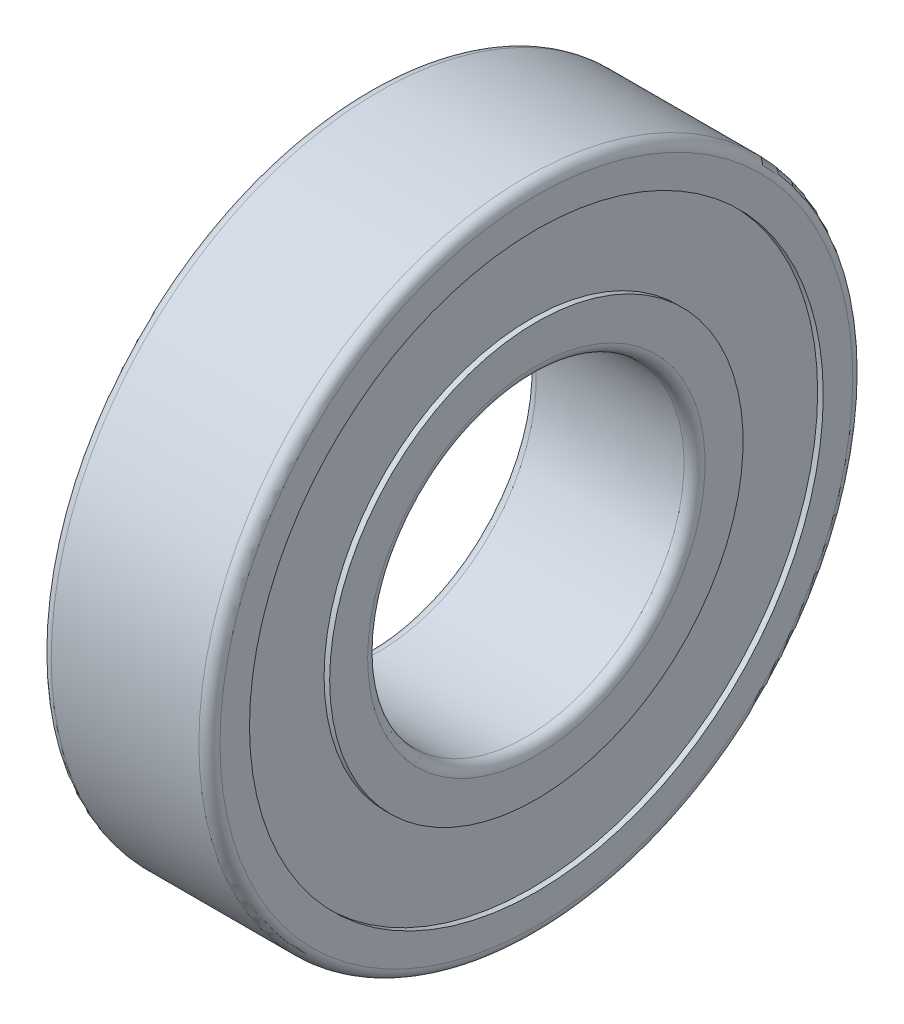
from build123d import *


with BuildPart() as part:
    # Sketch1 → Revolve1 (revolve)
    with BuildSketch(Plane.XY, mode=Mode.PRIVATE) as revolve1_sk:
        with BuildLine():
            Line((0, 30), (0, 27.2))
            Line((0, 27.2), (0.53, 27.2))
            Line((0.53, 27.2), (0.53, 19.6))
            Line((0.53, 19.6), (0, 19.6))
            Line((0, 19.6), (0, 16))
            ThreePointArc((0, 16), (0.292893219, 15.292893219), (1, 15))
            Line((1, 15), (15, 15))
            ThreePointArc((15, 15), (15.707106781, 15.292893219), (16, 16))
            Line((16, 16), (16, 19.6))
            Line((16, 19.6), (15.47, 19.6))
            Line((15.47, 19.6), (15.47, 27.2))
            Line((15.47, 27.2), (16, 27.2))
            Line((16, 27.2), (16, 30))
            ThreePointArc((16, 30), (15.707106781, 30.707106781), (15, 31))
            Line((15, 31), (1, 31))
            ThreePointArc((1, 31), (0.292893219, 30.707106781), (0, 30))
        make_face()
    revolve(revolve1_sk.sketch.rotate(Axis((16, 0, 0), (-1, 0, 0)), 270), axis=Axis((16, 0, 0), (-1, 0, 0)))


solid = part.part
